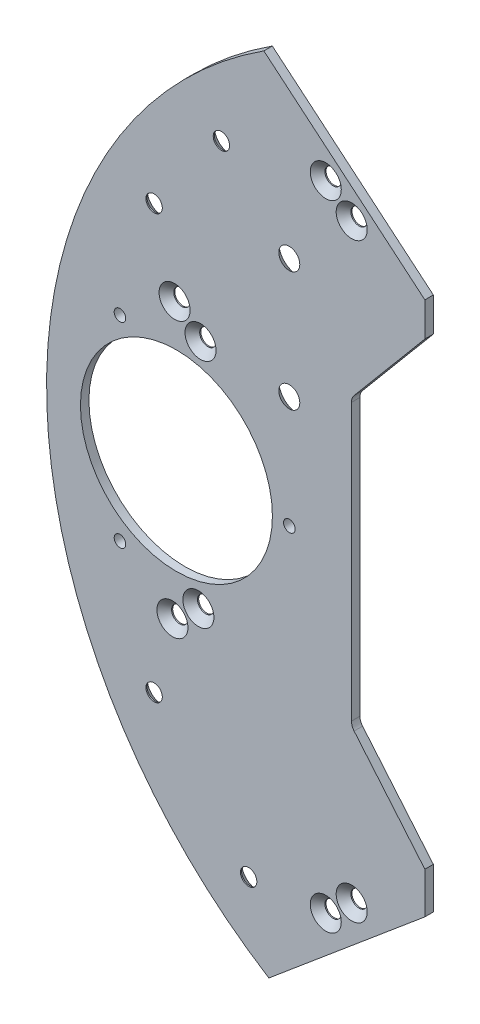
from build123d import *

# Parameters (mm, degrees)
RESSALTO_EXTRUS_O1_DEPTH                            = 1.5
ESBO_O2_R                                           = 17
CORTE_EXTRUS_O1_DEPTH                               = 1.5
FURO_ROSCADO_DE_M2_51_D                             = 2.05
CORTE_EXTRUS_O3_DEPTH                               = 1.5
ESCAREADO_PARA_PARAFUSO_COM_CABE_A_E_2_COUNT        = 2
ESCAREADO_PARA_PARAFUSO_COM_CABE_A_E_2_PITCH        = 6
ESCAREADO_PARA_PARAFUSO_COM_CABE_A_E_3_COUNT        = 2
ESCAREADO_PARA_PARAFUSO_COM_CABE_A_E_3_PITCH        = 42.154151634
ESCAREADO_PARA_PARAFUSO_COM_CABE_A_E_4_COUNT        = 2
ESCAREADO_PARA_PARAFUSO_COM_CABE_A_E_4_PITCH        = 41.653001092
ESCAREADO_PARA_PARAFUSO_COM_CABE_A_E_5_COUNT        = 2
ESCAREADO_PARA_PARAFUSO_COM_CABE_A_E_5_PITCH        = 85.214018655
ESCAREADO_PARA_PARAFUSO_COM_CABE_A_E_6_COUNT        = 2
ESCAREADO_PARA_PARAFUSO_COM_CABE_A_E_6_PITCH        = 83.210736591
ESCAREADO_PARA_PARAFUSO_COM_CABE_A_E_7_COUNT        = 2
ESCAREADO_PARA_PARAFUSO_COM_CABE_A_E_7_PITCH        = 48.867205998
ESCAREADO_PARA_PARAFUSO_COM_CABE_A_E_8_COUNT        = 2
ESCAREADO_PARA_PARAFUSO_COM_CABE_A_E_8_PITCH        = 45.283567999
ESCAREADO_PARA_PARAFUSO_COM_CABE_A_E_9_D            = 2.9
ESCAREADO_PARA_PARAFUSO_COM_CABE_A_E_9_DEPTH        = 7.25
ESCAREADO_PARA_PARAFUSO_COM_CABE_A_E_9_CSINK_D      = 5.5
ESCAREADO_PARA_PARAFUSO_COM_CABE_A_E_9_CSINK_ANGLE  = 90
ESCAREADO_PARA_PARAFUSO_COM_CABE_A_E_9_TIP          = 0.871247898
CORTE_EXTRUS_O7_DEPTH                               = 122.865704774
CORTE_EXTRUS_O8_DEPTH                               = 114.698293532
ESCAREADO_PARA_PARAFUSO_ALLEN_SEXTAVADO_D           = 3.4
ESCAREADO_PARA_PARAFUSO_ALLEN_SEXTAVADO_DEPTH       = 4
ESCAREADO_PARA_PARAFUSO_ALLEN_SEXTAVADO_CSINK_D     = 6.72
ESCAREADO_PARA_PARAFUSO_ALLEN_SEXTAVADO_CSINK_ANGLE = 90
ESCAREADO_PARA_PARAFUSO_ALLEN_SEXTAVADO_TIP         = 1.021463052


with BuildPart() as part:
    # Esbo_o1 → Ressalto-extrus_o1 (new body)
    with BuildSketch(Plane.XY):
        with BuildLine():
            Line((-17, 85.322916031), (-17, -85.322916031))
            ThreePointArc((-17, -85.322916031), (-87, 0), (-17, 85.322916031))
        make_face()
    extrude(amount=RESSALTO_EXTRUS_O1_DEPTH)

    # Esbo_o2 → Corte-extrus_o1 (cut)
    with BuildSketch(Plane.XY.offset(1.5)):
        with Locations((-61, 0)):
            Circle(ESBO_O2_R)
    extrude(amount=-CORTE_EXTRUS_O1_DEPTH, mode=Mode.SUBTRACT)

    # Furo roscado de M2.51 (through all)
    with Locations(Plane(origin=(-71, 17.320508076, 1.5), x_dir=(1, 0, 0), z_dir=(0, 0, 1))):
        with Locations((0, 0), (30, -17.320508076), (0, -34.641016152)):
            Hole(FURO_ROSCADO_DE_M2_51_D / 2)

    # Esbo_o6 → Corte-extrus_o3 (cut)
    with BuildSketch(Plane.XY.offset(1.5)):
        with BuildLine():
            Line((-30, -24.445048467), (-30, 24.445048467))
            ThreePointArc((-30, 24.445048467), (-29.879385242, 25.129088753), (-29.532088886, 25.730623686))
            Line((-29.532088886, 25.730623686), (-17, 40.665785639))
            Line((-17, 40.665785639), (-17, -40.665785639))
            Line((-17, -40.665785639), (-29.532088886, -25.730623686))
            ThreePointArc((-29.532088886, -25.730623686), (-29.879385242, -25.129088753), (-30, -24.445048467))
        make_face()
    extrude(amount=-CORTE_EXTRUS_O3_DEPTH, mode=Mode.SUBTRACT)

    # Esbo_o11 → Escareado para parafuso com cabe_a escar (revolve, cut)
    with BuildSketch(Plane(origin=(-61.707399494, -24.593549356, 1.5), x_dir=(0, -1, 0), z_dir=(1, 0, 0))):
        Polygon((0, 0), (0, 1.5), (1.45, 1.5), (1.45, 1.3), (2.75, 0), align=None)
    escareado_para_parafuso_com_cabe_a_escar = revolve(axis=Axis((-61.707399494, -24.593549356, 7.85), (0, 0, -1)), mode=Mode.SUBTRACT)

    # Escareado para parafuso com cabe_a e 2: Escareado para parafuso com cabe_a escar ×2
    with Locations(*[Vector(0.7660444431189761, 0.6427876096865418, 0) * (i * ESCAREADO_PARA_PARAFUSO_COM_CABE_A_E_2_PITCH) for i in range(1, ESCAREADO_PARA_PARAFUSO_COM_CABE_A_E_2_COUNT)]):
        add(escareado_para_parafuso_com_cabe_a_escar, mode=Mode.SUBTRACT)

    # Escareado para parafuso com cabe_a e 3: Escareado para parafuso com cabe_a escar ×2
    with Locations(*[Vector(0.7532210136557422, -0.6577675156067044, 0) * (i * ESCAREADO_PARA_PARAFUSO_COM_CABE_A_E_3_PITCH) for i in range(1, ESCAREADO_PARA_PARAFUSO_COM_CABE_A_E_3_COUNT)]):
        add(escareado_para_parafuso_com_cabe_a_escar, mode=Mode.SUBTRACT)

    # Escareado para parafuso com cabe_a e 4: Escareado para parafuso com cabe_a escar ×2
    with Locations(*[Vector(0.6519368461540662, -0.7582732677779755, 0) * (i * ESCAREADO_PARA_PARAFUSO_COM_CABE_A_E_4_PITCH) for i in range(1, ESCAREADO_PARA_PARAFUSO_COM_CABE_A_E_4_COUNT)]):
        add(escareado_para_parafuso_com_cabe_a_escar, mode=Mode.SUBTRACT)

    # Escareado para parafuso com cabe_a e 5: Escareado para parafuso com cabe_a escar ×2
    with Locations(*[Vector(0.31866970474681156, 0.9478658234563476, 0) * (i * ESCAREADO_PARA_PARAFUSO_COM_CABE_A_E_5_PITCH) for i in range(1, ESCAREADO_PARA_PARAFUSO_COM_CABE_A_E_5_COUNT)]):
        add(escareado_para_parafuso_com_cabe_a_escar, mode=Mode.SUBTRACT)

    # Escareado para parafuso com cabe_a e 6: Escareado para parafuso com cabe_a escar ×2
    with Locations(*[Vector(0.3815780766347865, 0.9243366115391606, 0) * (i * ESCAREADO_PARA_PARAFUSO_COM_CABE_A_E_6_PITCH) for i in range(1, ESCAREADO_PARA_PARAFUSO_COM_CABE_A_E_6_COUNT)]):
        add(escareado_para_parafuso_com_cabe_a_escar, mode=Mode.SUBTRACT)

    # Escareado para parafuso com cabe_a e 7: Escareado para parafuso com cabe_a escar ×2
    with Locations(*[Vector(0.007838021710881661, 0.9999692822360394, 0) * (i * ESCAREADO_PARA_PARAFUSO_COM_CABE_A_E_7_PITCH) for i in range(1, ESCAREADO_PARA_PARAFUSO_COM_CABE_A_E_7_COUNT)]):
        add(escareado_para_parafuso_com_cabe_a_escar, mode=Mode.SUBTRACT)

    # Escareado para parafuso com cabe_a e 8: Escareado para parafuso com cabe_a escar ×2
    with Locations(*[Vector(0.10995796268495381, 0.9939362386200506, 0) * (i * ESCAREADO_PARA_PARAFUSO_COM_CABE_A_E_8_PITCH) for i in range(1, ESCAREADO_PARA_PARAFUSO_COM_CABE_A_E_8_COUNT)]):
        add(escareado_para_parafuso_com_cabe_a_escar, mode=Mode.SUBTRACT)

    # Escareado para parafuso com cabe_a e 9
    with Locations(Plane(origin=(-48.209070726, -57.453333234, 0), x_dir=(-1, 0, 0), z_dir=(0, 0, -1))):
        with Locations((0, 0), (16.742834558, 19.953333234), (16.742834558, 94.953333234), (4.823937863, 110.486341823)):
            CounterSinkHole(ESCAREADO_PARA_PARAFUSO_COM_CABE_A_E_9_D / 2, ESCAREADO_PARA_PARAFUSO_COM_CABE_A_E_9_CSINK_D / 2, depth=ESCAREADO_PARA_PARAFUSO_COM_CABE_A_E_9_DEPTH, counter_sink_angle=ESCAREADO_PARA_PARAFUSO_COM_CABE_A_E_9_CSINK_ANGLE)
            with Locations((0, 0, -(ESCAREADO_PARA_PARAFUSO_COM_CABE_A_E_9_DEPTH + ESCAREADO_PARA_PARAFUSO_COM_CABE_A_E_9_TIP / 2))):  # 118° drill point
                Cone(0, ESCAREADO_PARA_PARAFUSO_COM_CABE_A_E_9_D / 2, ESCAREADO_PARA_PARAFUSO_COM_CABE_A_E_9_TIP, mode=Mode.SUBTRACT)

    # Esbo_o19 → Corte-extrus_o7 (cut, through all)
    with BuildSketch(Plane(origin=(0, 0, 0), x_dir=(-1, 0, 0), z_dir=(0, 0, -1))):
        Polygon((31.98112289, 59.242084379), (17, 46.671429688), (17, 85.322916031), (63.063047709, 85.322916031), align=None)
        Polygon((31.33833528, -60.008128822), (17, -47.976836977), (17, -85.322916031), (61.507323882, -85.322916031), align=None)
    extrude(amount=-CORTE_EXTRUS_O7_DEPTH, mode=Mode.SUBTRACT)

    # Esbo_o20 → Corte-extrus_o8 (cut, through all)
    with BuildSketch(Plane(origin=(0, 0, 0), x_dir=(-1, 0, 0), z_dir=(0, 0, -1))):
        with BuildLine():
            Line((47.91785698, 72.614592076), (45.51622644, 70.599384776))
            ThreePointArc((45.51622644, 70.599384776), (83.998363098, -0.524401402), (44.631209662, -71.162174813))
            Line((44.631209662, -71.162174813), (47.04198176, -73.185052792))
            ThreePointArc((47.04198176, -73.185052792), (86.998430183, -0.522633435), (47.91785698, 72.614592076))
        make_face()
    extrude(amount=-CORTE_EXTRUS_O8_DEPTH, mode=Mode.SUBTRACT)

    # Escareado para parafuso Allen sextavado
    with Locations(Plane(origin=(-41.012193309, 19.798989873, 0), x_dir=(-1, 0, 0), z_dir=(0, 0, -1))):
        with Locations((0, 0), (0, 21.213203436)):
            CounterSinkHole(ESCAREADO_PARA_PARAFUSO_ALLEN_SEXTAVADO_D / 2, ESCAREADO_PARA_PARAFUSO_ALLEN_SEXTAVADO_CSINK_D / 2, depth=ESCAREADO_PARA_PARAFUSO_ALLEN_SEXTAVADO_DEPTH, counter_sink_angle=ESCAREADO_PARA_PARAFUSO_ALLEN_SEXTAVADO_CSINK_ANGLE)
            with Locations((0, 0, -(ESCAREADO_PARA_PARAFUSO_ALLEN_SEXTAVADO_DEPTH + ESCAREADO_PARA_PARAFUSO_ALLEN_SEXTAVADO_TIP / 2))):  # 118° drill point
                Cone(0, ESCAREADO_PARA_PARAFUSO_ALLEN_SEXTAVADO_D / 2, ESCAREADO_PARA_PARAFUSO_ALLEN_SEXTAVADO_TIP, mode=Mode.SUBTRACT)


solid = part.part
